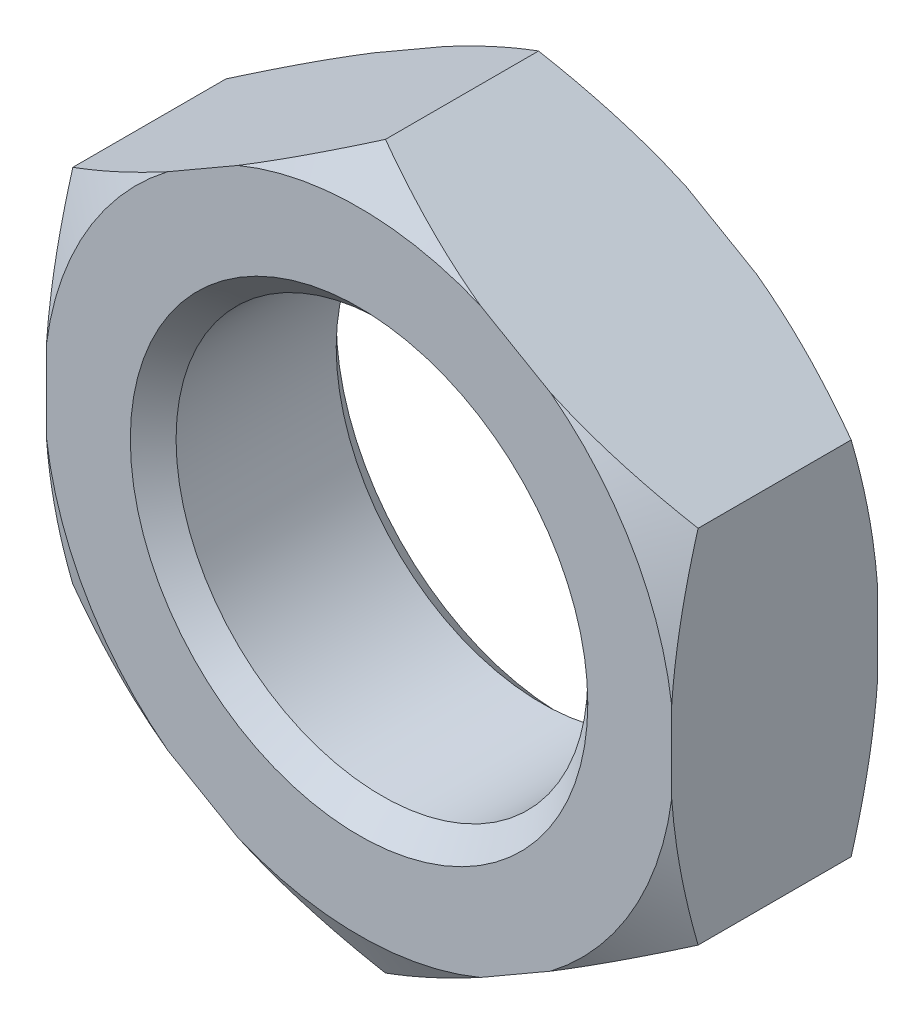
from build123d import *

# Parameters (mm, degrees)
BOSS_EXTRUDE1_DEPTH = 6.75
SKETCH6_R           = 13.5
CUT_EXTRUDE1_DEPTH  = 13.5
CHAMFER1_SIZE       = 1.5


with BuildPart() as part:
    # Sketch3 → Boss-Extrude1 (new, symmetric)
    with BuildSketch(Plane.XY):
        Polygon((0, 23.671361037), (-20.5, 11.835680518), (-20.5, -11.835680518), (0, -23.671361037), (20.5, -11.835680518), (20.5, 11.835680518), align=None)
    extrude(amount=BOSS_EXTRUDE1_DEPTH, both=True)

    # Sketch5 → Cut-Revolve1 (revolve, cut)
    with BuildSketch(Plane(origin=(0, 0, 0), x_dir=(0, 0, -1), z_dir=(1, 0, 0))):
        Polygon((-6.75, 23.671361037), (-6.75, 20.671361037), (-5.017949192, 23.671361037), align=None)
    cut_revolve1 = revolve(axis=Axis((0, 0, 5.457798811), (0, 0, -1)), mode=Mode.SUBTRACT)

    # Mirror1: Cut-Revolve1 across plane
    add(cut_revolve1.mirror(Plane.XY), mode=Mode.SUBTRACT)

    # Sketch6 → Cut-Extrude1 (cut)
    with BuildSketch(Plane.XY.offset(6.75)):
        Circle(SKETCH6_R)
    extrude(amount=-CUT_EXTRUDE1_DEPTH, mode=Mode.SUBTRACT)

    # Chamfer1
    chamfer1_edges = [part.edges().sort_by_distance(p)[0] for p in [
        (-13.5, 0, -6.75),
        (-13.5, 0, 6.75),
    ]]
    chamfer(chamfer1_edges, length=CHAMFER1_SIZE)


solid = part.part
